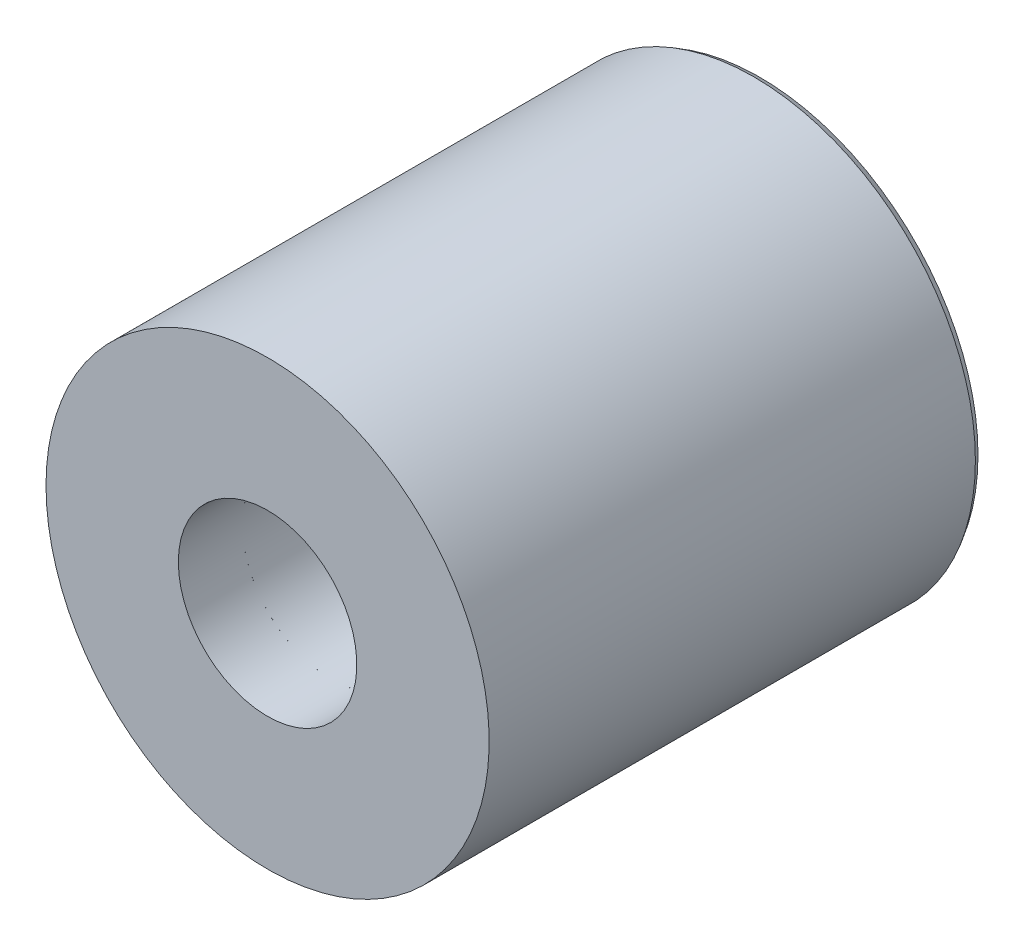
ISO-10303-21;
HEADER;
FILE_DESCRIPTION(('STEP AP214'),'2;1');
FILE_NAME('part.step','',(''),(''),'','','');
FILE_SCHEMA(('AUTOMOTIVE_DESIGN { 1 0 10303 214 1 1 1 1 }'));
ENDSEC;
DATA;
#1=APPLICATION_CONTEXT('core data for automotive mechanical design processes');
#2=APPLICATION_PROTOCOL_DEFINITION('international standard','automotive_design',2000,#1);
#3=PRODUCT_CONTEXT('',#1,'mechanical');
#4=PRODUCT('Part','Part','',(#3));
#5=PRODUCT_RELATED_PRODUCT_CATEGORY('part','',(#4));
#6=PRODUCT_DEFINITION_FORMATION('','',#4);
#7=PRODUCT_DEFINITION_CONTEXT('part definition',#1,'design');
#8=PRODUCT_DEFINITION('design','',#6,#7);
#9=PRODUCT_DEFINITION_SHAPE('','',#8);
#10=(LENGTH_UNIT() NAMED_UNIT(*) SI_UNIT(.MILLI.,.METRE.));
#11=(NAMED_UNIT(*) PLANE_ANGLE_UNIT() SI_UNIT($,.RADIAN.));
#12=(NAMED_UNIT(*) SI_UNIT($,.STERADIAN.) SOLID_ANGLE_UNIT());
#13=UNCERTAINTY_MEASURE_WITH_UNIT(LENGTH_MEASURE(1.E-05),#10,'distance_accuracy_value','');
#14=(GEOMETRIC_REPRESENTATION_CONTEXT(3) GLOBAL_UNCERTAINTY_ASSIGNED_CONTEXT((#13)) GLOBAL_UNIT_ASSIGNED_CONTEXT((#10,
#11,#12)) REPRESENTATION_CONTEXT('',''));
#15=CARTESIAN_POINT('',(0.,0.,0.));
#16=DIRECTION('',(0.,0.,1.));
#17=DIRECTION('',(1.,0.,0.));
#18=AXIS2_PLACEMENT_3D('',#15,#16,#17);
#19=CARTESIAN_POINT('',(0.,0.,5.124525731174));
#20=DIRECTION('',(0.,0.,-1.));
#21=DIRECTION('',(-1.,0.,0.));
#22=AXIS2_PLACEMENT_3D('',#19,#20,#21);
#23=CYLINDRICAL_SURFACE('',#22,4.);
#24=CARTESIAN_POINT('',(0.,0.,-2.6));
#25=DIRECTION('',(0.,0.,-1.));
#26=DIRECTION('',(-1.,0.,0.));
#27=AXIS2_PLACEMENT_3D('',#24,#25,#26);
#28=CIRCLE('',#27,4.);
#29=CARTESIAN_POINT('',(-4.,0.,-2.6));
#30=VERTEX_POINT('',#29);
#31=EDGE_CURVE('P0_E11',#30,#30,#28,.T.);
#32=ORIENTED_EDGE('',*,*,#31,.T.);
#33=EDGE_LOOP('',(#32));
#34=FACE_BOUND('',#33,.T.);
#35=CARTESIAN_POINT('',(0.,0.,-20.));
#36=DIRECTION('',(0.,0.,-1.));
#37=DIRECTION('',(-1.,0.,0.));
#38=AXIS2_PLACEMENT_3D('',#35,#36,#37);
#39=CIRCLE('',#38,4.);
#40=CARTESIAN_POINT('',(-4.,0.,-20.));
#41=VERTEX_POINT('',#40);
#42=EDGE_CURVE('P0_E23',#41,#41,#39,.F.);
#43=ORIENTED_EDGE('',*,*,#42,.T.);
#44=EDGE_LOOP('',(#43));
#45=FACE_BOUND('',#44,.T.);
#46=ADVANCED_FACE('P0_F16',(#34,#45),#23,.T.);
#47=CARTESIAN_POINT('',(0.,0.,-2.6));
#48=DIRECTION('',(0.,0.,-1.));
#49=DIRECTION('',(-1.,0.,0.));
#50=AXIS2_PLACEMENT_3D('',#47,#48,#49);
#51=PLANE('',#50);
#52=CARTESIAN_POINT('',(3.625,0.,-2.6));
#53=CARTESIAN_POINT('',(3.62479760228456,0.691689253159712,-2.6));
#54=CARTESIAN_POINT('',(3.37048259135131,1.33434332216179,-2.6));
#55=CARTESIAN_POINT('',(3.09442471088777,2.03194162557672,-2.6));
#56=CARTESIAN_POINT('',(2.56326208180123,2.56326208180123,-2.6));
#57=CARTESIAN_POINT('',(2.03284453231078,3.09383723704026,-2.6));
#58=CARTESIAN_POINT('',(1.33434332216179,3.37048259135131,-2.6));
#59=CARTESIAN_POINT('',(0.691968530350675,3.62489876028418,-2.6));
#60=CARTESIAN_POINT('',(0.,3.625,-2.6));
#61=CARTESIAN_POINT('',(-0.690922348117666,3.62510108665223,-2.6));
#62=CARTESIAN_POINT('',(-1.33434332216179,3.37048259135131,-2.6));
#63=CARTESIAN_POINT('',(-2.03194162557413,3.09442471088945,-2.6));
#64=CARTESIAN_POINT('',(-2.56326208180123,2.56326208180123,-2.6));
#65=CARTESIAN_POINT('',(-3.09383723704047,2.03284453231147,-2.6));
#66=CARTESIAN_POINT('',(-3.37048259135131,1.33434332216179,-2.6));
#67=CARTESIAN_POINT('',(-3.62479744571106,0.692224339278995,-2.6));
#68=CARTESIAN_POINT('',(-3.625,0.,-2.6));
#69=B_SPLINE_CURVE_WITH_KNOTS('',2,(#52,#53,#54,#55,#56,#57,#58,#59,#60,#61,#62,#63,#64,#65,#66,
#67,#68),.UNSPECIFIED.,.F.,.F.,(3,2,2,2,2,2,2,2,3),(0.,0.125,0.25,0.375,0.5,0.625,0.75,0.875,
1.),.UNSPECIFIED.);
#70=CARTESIAN_POINT('',(3.625,0.,-2.6));
#71=VERTEX_POINT('',#70);
#72=CARTESIAN_POINT('',(-3.625,0.,-2.6));
#73=VERTEX_POINT('',#72);
#74=EDGE_CURVE('P0_E27',#71,#73,#69,.T.);
#75=ORIENTED_EDGE('',*,*,#74,.F.);
#76=CARTESIAN_POINT('',(-3.625,0.,-2.6));
#77=CARTESIAN_POINT('',(-3.62479760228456,-0.691689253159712,-2.6));
#78=CARTESIAN_POINT('',(-3.37048259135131,-1.33434332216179,-2.6));
#79=CARTESIAN_POINT('',(-3.09442471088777,-2.03194162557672,-2.6));
#80=CARTESIAN_POINT('',(-2.56326208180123,-2.56326208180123,-2.6));
#81=CARTESIAN_POINT('',(-2.03284453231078,-3.09383723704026,-2.6));
#82=CARTESIAN_POINT('',(-1.33434332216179,-3.37048259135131,-2.6));
#83=CARTESIAN_POINT('',(-0.691968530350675,-3.62489876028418,-2.6));
#84=CARTESIAN_POINT('',(0.,-3.625,-2.6));
#85=CARTESIAN_POINT('',(0.690922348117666,-3.62510108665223,-2.6));
#86=CARTESIAN_POINT('',(1.33434332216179,-3.37048259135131,-2.6));
#87=CARTESIAN_POINT('',(2.03194162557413,-3.09442471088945,-2.6));
#88=CARTESIAN_POINT('',(2.56326208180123,-2.56326208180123,-2.6));
#89=CARTESIAN_POINT('',(3.09383723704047,-2.03284453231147,-2.6));
#90=CARTESIAN_POINT('',(3.37048259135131,-1.33434332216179,-2.6));
#91=CARTESIAN_POINT('',(3.62479744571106,-0.692224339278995,-2.6));
#92=CARTESIAN_POINT('',(3.625,0.,-2.6));
#93=B_SPLINE_CURVE_WITH_KNOTS('',2,(#76,#77,#78,#79,#80,#81,#82,#83,#84,#85,#86,#87,#88,#89,#90,
#91,#92),.UNSPECIFIED.,.F.,.F.,(3,2,2,2,2,2,2,2,3),(0.,0.125,0.25,0.375,0.5,0.625,0.75,0.875,
1.),.UNSPECIFIED.);
#94=EDGE_CURVE('P0_E32',#73,#71,#93,.T.);
#95=ORIENTED_EDGE('',*,*,#94,.F.);
#96=EDGE_LOOP('',(#75,#95));
#97=FACE_BOUND('',#96,.T.);
#98=ORIENTED_EDGE('',*,*,#31,.F.);
#99=EDGE_LOOP('',(#98));
#100=FACE_BOUND('',#99,.T.);
#101=ADVANCED_FACE('P0_F17',(#97,#100),#51,.F.);
#102=OPEN_SHELL('',(#46,#101));
#103=SHELL_BASED_SURFACE_MODEL('P0_B1',(#102));
#104=CARTESIAN_POINT('',(0.,0.,5.124525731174));
#105=DIRECTION('',(0.,0.,-1.));
#106=DIRECTION('',(-1.,0.,0.));
#107=AXIS2_PLACEMENT_3D('',#104,#105,#106);
#108=CYLINDRICAL_SURFACE('',#107,3.625);
#109=CARTESIAN_POINT('',(0.,0.,0.));
#110=DIRECTION('',(0.,0.,-1.));
#111=DIRECTION('',(-1.,0.,0.));
#112=AXIS2_PLACEMENT_3D('',#109,#110,#111);
#113=CIRCLE('',#112,3.625);
#114=CARTESIAN_POINT('',(-3.625,0.,0.));
#115=VERTEX_POINT('',#114);
#116=EDGE_CURVE('P1_E30',#115,#115,#113,.F.);
#117=ORIENTED_EDGE('',*,*,#116,.T.);
#118=EDGE_LOOP('',(#117));
#119=FACE_BOUND('',#118,.T.);
#120=CARTESIAN_POINT('',(0.,0.,-20.));
#121=DIRECTION('',(0.,0.,-1.));
#122=DIRECTION('',(-1.,0.,0.));
#123=AXIS2_PLACEMENT_3D('',#120,#121,#122);
#124=CIRCLE('',#123,3.625);
#125=CARTESIAN_POINT('',(-3.625,0.,-20.));
#126=VERTEX_POINT('',#125);
#127=EDGE_CURVE('P1_E17',#126,#126,#124,.F.);
#128=ORIENTED_EDGE('',*,*,#127,.F.);
#129=EDGE_LOOP('',(#128));
#130=FACE_BOUND('',#129,.T.);
#131=ADVANCED_FACE('P1_F14',(#119,#130),#108,.F.);
#132=CARTESIAN_POINT('',(0.,0.,-20.));
#133=DIRECTION('',(0.,0.,-1.));
#134=DIRECTION('',(-1.,0.,0.));
#135=AXIS2_PLACEMENT_3D('',#132,#133,#134);
#136=PLANE('',#135);
#137=ORIENTED_EDGE('',*,*,#127,.T.);
#138=EDGE_LOOP('',(#137));
#139=FACE_BOUND('',#138,.T.);
#140=CARTESIAN_POINT('',(0.,0.,-19.9999999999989));
#141=DIRECTION('',(0.,0.,1.));
#142=DIRECTION('',(1.,0.,0.));
#143=AXIS2_PLACEMENT_3D('',#140,#141,#142);
#144=CIRCLE('',#143,8.85566243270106);
#145=CARTESIAN_POINT('',(8.85566243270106,0.,-19.9999999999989));
#146=VERTEX_POINT('',#145);
#147=EDGE_CURVE('P1_E26',#146,#146,#144,.T.);
#148=ORIENTED_EDGE('',*,*,#147,.F.);
#149=EDGE_LOOP('',(#148));
#150=FACE_BOUND('',#149,.T.);
#151=ADVANCED_FACE('P1_F37',(#139,#150),#136,.T.);
#152=CARTESIAN_POINT('',(0.,0.,0.));
#153=DIRECTION('',(0.,0.,-1.));
#154=DIRECTION('',(-1.,0.,0.));
#155=AXIS2_PLACEMENT_3D('',#152,#153,#154);
#156=PLANE('',#155);
#157=ORIENTED_EDGE('',*,*,#116,.F.);
#158=EDGE_LOOP('',(#157));
#159=FACE_BOUND('',#158,.T.);
#160=CARTESIAN_POINT('',(0.,0.,0.));
#161=DIRECTION('',(0.,0.,-1.));
#162=DIRECTION('',(-1.,0.,0.));
#163=AXIS2_PLACEMENT_3D('',#160,#161,#162);
#164=CIRCLE('',#163,9.);
#165=CARTESIAN_POINT('',(-9.,0.,0.));
#166=VERTEX_POINT('',#165);
#167=EDGE_CURVE('P1_E21',#166,#166,#164,.T.);
#168=ORIENTED_EDGE('',*,*,#167,.F.);
#169=EDGE_LOOP('',(#168));
#170=FACE_BOUND('',#169,.T.);
#171=ADVANCED_FACE('P1_F46',(#159,#170),#156,.F.);
#172=CARTESIAN_POINT('',(0.,0.,-19.749999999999));
#173=DIRECTION('',(0.,0.,1.));
#174=DIRECTION('',(1.,0.,0.));
#175=AXIS2_PLACEMENT_3D('',#172,#173,#174);
#176=CONICAL_SURFACE('',#175,8.99999999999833,0.523598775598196);
#177=ORIENTED_EDGE('',*,*,#147,.T.);
#178=EDGE_LOOP('',(#177));
#179=FACE_BOUND('',#178,.T.);
#180=CARTESIAN_POINT('',(0.,0.,-19.75));
#181=DIRECTION('',(0.,0.,-1.));
#182=DIRECTION('',(-1.,0.,0.));
#183=AXIS2_PLACEMENT_3D('',#180,#181,#182);
#184=CIRCLE('',#183,9.);
#185=CARTESIAN_POINT('',(-9.,0.,-19.75));
#186=VERTEX_POINT('',#185);
#187=EDGE_CURVE('P1_E10',#186,#186,#184,.F.);
#188=ORIENTED_EDGE('',*,*,#187,.F.);
#189=EDGE_LOOP('',(#188));
#190=FACE_BOUND('',#189,.T.);
#191=ADVANCED_FACE('P1_F49',(#179,#190),#176,.T.);
#192=CARTESIAN_POINT('',(0.,0.,1.));
#193=DIRECTION('',(0.,0.,-1.));
#194=DIRECTION('',(-1.,0.,0.));
#195=AXIS2_PLACEMENT_3D('',#192,#193,#194);
#196=CYLINDRICAL_SURFACE('',#195,9.);
#197=ORIENTED_EDGE('',*,*,#167,.T.);
#198=EDGE_LOOP('',(#197));
#199=FACE_BOUND('',#198,.T.);
#200=ORIENTED_EDGE('',*,*,#187,.T.);
#201=EDGE_LOOP('',(#200));
#202=FACE_BOUND('',#201,.T.);
#203=ADVANCED_FACE('P1_F47',(#199,#202),#196,.T.);
#204=CLOSED_SHELL('',(#131,#151,#171,#191,#203));
#205=MANIFOLD_SOLID_BREP('P1_B1',#204);
#206=ADVANCED_BREP_SHAPE_REPRESENTATION('',(#18,#205),#14);
#207=MANIFOLD_SURFACE_SHAPE_REPRESENTATION('',(#18,#103),#14);
#208=SHAPE_REPRESENTATION('',(#18),#14);
#209=SHAPE_DEFINITION_REPRESENTATION(#9,#208);
#210=SHAPE_REPRESENTATION_RELATIONSHIP('','',#208,#206);
#211=SHAPE_REPRESENTATION_RELATIONSHIP('','',#208,#207);
ENDSEC;
END-ISO-10303-21;
